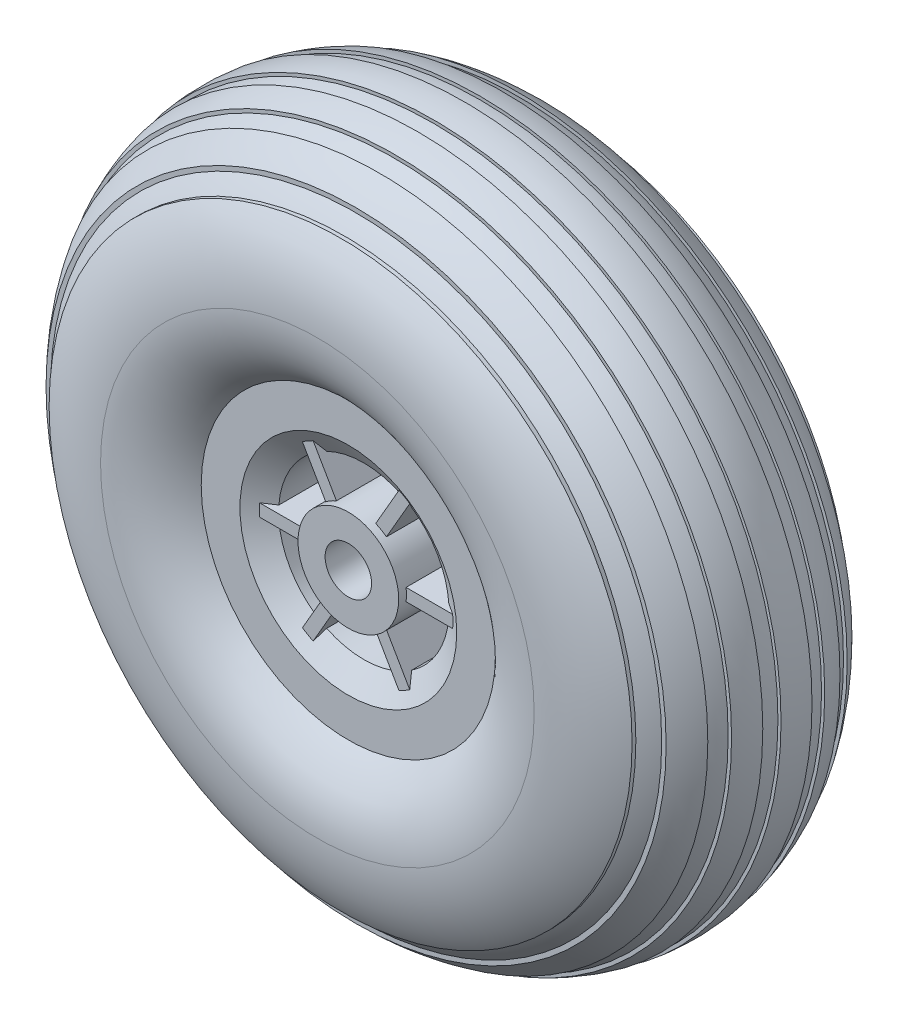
from build123d import *

# Parameters (mm, degrees)
BOSS_EXTRU_1_DEPTH           = 0.4
R_P_TITION_CIRCULAIRE1_COUNT = 6
SYM_TRIE1_COPY_1_DEPTH       = 0.4
SYM_TRIE1_COPY_2_DEPTH       = 0.4
SYM_TRIE1_COPY_3_DEPTH       = 0.4
SYM_TRIE1_COPY_4_DEPTH       = 0.4
SYM_TRIE1_COPY_5_DEPTH       = 0.4


with BuildPart() as part:
    # Esquisse1 → R_volution1 (revolve)
    with BuildSketch(Plane(origin=(0, 0, 0), x_dir=(0, 0, -1), z_dir=(1, 0, 0)), mode=Mode.PRIVATE) as r_volution1_sk:
        Polygon((6.5, 1.5), (-6.5, 1.5), (-6.5, 3.25), (-2, 3.25), (-2, 5.5), (-5.5, 5.5), (-6.5, 7), (-6.5, 9.5), (-6, 9.5), (-6, 7.151387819), (-5.232408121, 6), (5.232408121, 6), (6, 7.151387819), (6, 9.5), (6.5, 9.5), (6.5, 7), (5.5, 5.5), (2, 5.5), (2, 3.25), (6.5, 3.25), align=None)
    revolve(r_volution1_sk.sketch.rotate(Axis((0, 0, 0), (0, 0, -1)), 90), axis=Axis((0, 0, 0), (0, 0, -1)))

    # Esquisse2 → Boss.-Extru.1 (add, symmetric)
    with BuildSketch(Plane(origin=(0, 0, 0), x_dir=(1, 0, 0), z_dir=(0, 1, 0))):
        Polygon((2.5, 6), (2.5, 2), (5.5, 2), (5.5, 5.5), (6.25, 6), align=None)
    boss_extru_1 = extrude(amount=BOSS_EXTRU_1_DEPTH, both=True)

    # R_p_tition circulaire1: Boss.-Extru.1 ×6 about axis
    r_p_tition_circulaire1_axis = Axis((0, 0, 0), (0, 0, 1))
    for i in range(1, R_P_TITION_CIRCULAIRE1_COUNT):
        add(boss_extru_1.rotate(r_p_tition_circulaire1_axis, i * 360 / R_P_TITION_CIRCULAIRE1_COUNT))

    # Sym_trie1: Boss.-Extru.1 across plane
    add(boss_extru_1.mirror(Plane.XY))

    # Sym_trie1 copy 1 sketch → Sym_trie1 copy 1 (add, symmetric)
    with BuildSketch(Plane(origin=(0, 0, 0), x_dir=(0.5000000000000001, 0.8660254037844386, 0), z_dir=(-0.8660254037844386, 0.5000000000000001, 0))):
        Polygon((2.5, -6), (2.5, -2), (5.5, -2), (5.5, -5.5), (6.25, -6), align=None)
    extrude(amount=SYM_TRIE1_COPY_1_DEPTH, both=True)

    # Sym_trie1 copy 2 sketch → Sym_trie1 copy 2 (add, symmetric)
    with BuildSketch(Plane(origin=(0, 0, 0), x_dir=(-0.4999999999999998, 0.8660254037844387, 0), z_dir=(-0.8660254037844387, -0.4999999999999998, 0))):
        Polygon((2.5, -6), (2.5, -2), (5.5, -2), (5.5, -5.5), (6.25, -6), align=None)
    extrude(amount=SYM_TRIE1_COPY_2_DEPTH, both=True)

    # Sym_trie1 copy 3 sketch → Sym_trie1 copy 3 (add, symmetric)
    with BuildSketch(Plane(origin=(0, 0, 0), x_dir=(-1, 0, 0), z_dir=(0, -1, 0))):
        Polygon((2.5, -6), (2.5, -2), (5.5, -2), (5.5, -5.5), (6.25, -6), align=None)
    extrude(amount=SYM_TRIE1_COPY_3_DEPTH, both=True)

    # Sym_trie1 copy 4 sketch → Sym_trie1 copy 4 (add, symmetric)
    with BuildSketch(Plane(origin=(0, 0, 0), x_dir=(-0.5000000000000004, -0.8660254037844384, 0), z_dir=(0.8660254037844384, -0.5000000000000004, 0))):
        Polygon((2.5, -6), (2.5, -2), (5.5, -2), (5.5, -5.5), (6.25, -6), align=None)
    extrude(amount=SYM_TRIE1_COPY_4_DEPTH, both=True)

    # Sym_trie1 copy 5 sketch → Sym_trie1 copy 5 (add, symmetric)
    with BuildSketch(Plane(origin=(0, 0, 0), x_dir=(0.5000000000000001, -0.8660254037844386, 0), z_dir=(0.8660254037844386, 0.5000000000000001, 0))):
        Polygon((2.5, -6), (2.5, -2), (5.5, -2), (5.5, -5.5), (6.25, -6), align=None)
    extrude(amount=SYM_TRIE1_COPY_5_DEPTH, both=True)

    # Esquisse5 → R_volution3 (revolve)
    with BuildSketch(Plane(origin=(0, 0, 0), x_dir=(0, 0, -1), z_dir=(1, 0, 0)), mode=Mode.PRIVATE) as r_volution3_sk:
        with BuildLine():
            Line((-6.5, 9.5), (-6, 9.5))
            Line((-6, 9.5), (-6, 7.151387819))
            Line((-6, 7.151387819), (-5.232408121, 6))
            Line((-5.232408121, 6), (5.232408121, 6))
            Line((5.232408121, 6), (6, 7.151387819))
            Line((6, 7.151387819), (6, 9.5))
            Line((6, 9.5), (6.5, 9.5))
            ThreePointArc((6.5, 9.5), (7.977482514, 11.53778555), (8.5, 14))
            ThreePointArc((8.5, 14), (0, 22.5), (-8.5, 14))
            ThreePointArc((-8.5, 14), (-7.977482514, 11.53778555), (-6.5, 9.5))
        make_face()
    revolve(r_volution3_sk.sketch.rotate(Axis((0, 0, 0), (0, 0, 1)), 90), axis=Axis((0, 0, 0), (0, 0, 1)))

    # Esquisse6 → Enl_vement de mati_re-R_volution4 (revolve, cut)
    with BuildSketch(Plane(origin=(0, 0, 0), x_dir=(1, 0, 0), z_dir=(0, 1, 0)), mode=Mode.PRIVATE) as enl_vement_de_mati_re_r_volution4_sk:
        with BuildLine():
            Line((-22.440971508, 1), (-22.239538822, 1))
            ThreePointArc((-22.239538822, 1), (-22.162813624, 1.502821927), (-22.055432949, 2))
            Line((-22.055432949, 2), (-22.261355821, 2))
            ThreePointArc((-22.261355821, 2), (-22.366118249, 1.502686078), (-22.440971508, 1))
        make_face()
        with BuildLine():
            Line((-21.745966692, 3.5), (-21.525955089, 3.5))
            ThreePointArc((-21.525955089, 3.5), (-21.267317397, 4.009500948), (-20.97423831, 4.5))
            Line((-20.97423831, 4.5), (-21.211102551, 4.5))
            ThreePointArc((-21.211102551, 4.5), (-21.495230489, 4.008930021), (-21.745966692, 3.5))
        make_face()
        with BuildLine():
            Line((-20.020797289, 6), (-19.734980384, 6))
            ThreePointArc((-19.734980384, 6), (-19.291911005, 6.394190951), (-18.82182538, 6.755738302))
            Line((-18.82182538, 6.755738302), (-18.82182538, 7))
            ThreePointArc((-18.82182538, 7), (-19.444319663, 6.527586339), (-20.020797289, 6))
        make_face()
        with BuildLine():
            Line((-18.82182538, -7), (-18.82182538, -6.755738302))
            ThreePointArc((-18.82182538, -6.755738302), (-19.291911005, -6.394190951), (-19.734980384, -6))
            Line((-19.734980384, -6), (-20.020797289, -6))
            ThreePointArc((-20.020797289, -6), (-19.444319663, -6.527586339), (-18.82182538, -7))
        make_face()
        with BuildLine():
            Line((-21.211102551, -4.5), (-20.97423831, -4.5))
            ThreePointArc((-20.97423831, -4.5), (-21.267317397, -4.009500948), (-21.525955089, -3.5))
            Line((-21.525955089, -3.5), (-21.745966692, -3.5))
            ThreePointArc((-21.745966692, -3.5), (-21.495230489, -4.008930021), (-21.211102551, -4.5))
        make_face()
        with BuildLine():
            Line((-22.261355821, -2), (-22.055432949, -2))
            ThreePointArc((-22.055432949, -2), (-22.162813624, -1.502821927), (-22.239538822, -1))
            Line((-22.239538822, -1), (-22.440971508, -1))
            ThreePointArc((-22.440971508, -1), (-22.366118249, -1.502686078), (-22.261355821, -2))
        make_face()
    revolve(enl_vement_de_mati_re_r_volution4_sk.sketch.rotate(Axis((0, 0, 0), (0, 0, -1)), 180), axis=Axis((0, 0, 0), (0, 0, -1)), mode=Mode.SUBTRACT)


solid = part.part
